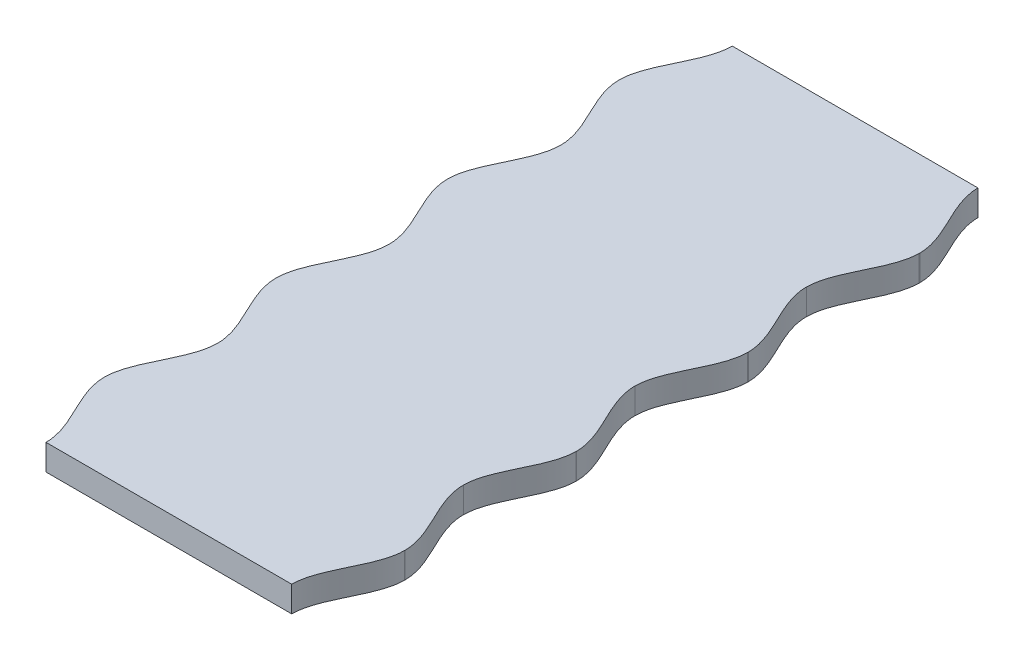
ISO-10303-21;
HEADER;
FILE_DESCRIPTION(('STEP AP214'),'2;1');
FILE_NAME('part.step','',(''),(''),'','','');
FILE_SCHEMA(('AUTOMOTIVE_DESIGN { 1 0 10303 214 1 1 1 1 }'));
ENDSEC;
DATA;
#1=APPLICATION_CONTEXT('core data for automotive mechanical design processes');
#2=APPLICATION_PROTOCOL_DEFINITION('international standard','automotive_design',2000,#1);
#3=PRODUCT_CONTEXT('',#1,'mechanical');
#4=PRODUCT('Part','Part','',(#3));
#5=PRODUCT_RELATED_PRODUCT_CATEGORY('part','',(#4));
#6=PRODUCT_DEFINITION_FORMATION('','',#4);
#7=PRODUCT_DEFINITION_CONTEXT('part definition',#1,'design');
#8=PRODUCT_DEFINITION('design','',#6,#7);
#9=PRODUCT_DEFINITION_SHAPE('','',#8);
#10=(LENGTH_UNIT() NAMED_UNIT(*) SI_UNIT(.MILLI.,.METRE.));
#11=(NAMED_UNIT(*) PLANE_ANGLE_UNIT() SI_UNIT($,.RADIAN.));
#12=(NAMED_UNIT(*) SI_UNIT($,.STERADIAN.) SOLID_ANGLE_UNIT());
#13=UNCERTAINTY_MEASURE_WITH_UNIT(LENGTH_MEASURE(1.E-05),#10,'distance_accuracy_value','');
#14=(GEOMETRIC_REPRESENTATION_CONTEXT(3) GLOBAL_UNCERTAINTY_ASSIGNED_CONTEXT((#13)) GLOBAL_UNIT_ASSIGNED_CONTEXT((#10,
#11,#12)) REPRESENTATION_CONTEXT('',''));
#15=CARTESIAN_POINT('',(0.,0.,0.));
#16=DIRECTION('',(0.,0.,1.));
#17=DIRECTION('',(1.,0.,0.));
#18=AXIS2_PLACEMENT_3D('',#15,#16,#17);
#19=CARTESIAN_POINT('',(-14.31965,3.,-80.));
#20=CARTESIAN_POINT('',(-14.31965,3.,-76.7188));
#21=CARTESIAN_POINT('',(-17.40275,3.,-73.4373));
#22=CARTESIAN_POINT('',(-17.49925,3.,-70.1561));
#23=B_SPLINE_CURVE_WITH_KNOTS('',3,(#19,#20,#21,#22),.UNSPECIFIED.,.F.,.F.,(4,4),
(0.961538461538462,1.),.UNSPECIFIED.);
#24=DIRECTION('',(0.,-1.,0.));
#25=VECTOR('',#24,1.);
#26=SURFACE_OF_LINEAR_EXTRUSION('',#23,#25);
#27=CARTESIAN_POINT('',(-14.31965,0.,-80.));
#28=CARTESIAN_POINT('',(-14.31965,0.,-76.7188));
#29=CARTESIAN_POINT('',(-17.40275,0.,-73.4373));
#30=CARTESIAN_POINT('',(-17.49925,0.,-70.1561));
#31=B_SPLINE_CURVE_WITH_KNOTS('',3,(#27,#28,#29,#30),.UNSPECIFIED.,.F.,.F.,(4,4),
(0.961538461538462,1.),.UNSPECIFIED.);
#32=CARTESIAN_POINT('',(-14.31965,0.,-80.));
#33=VERTEX_POINT('',#32);
#34=CARTESIAN_POINT('',(-17.49925,0.,-70.1561));
#35=VERTEX_POINT('',#34);
#36=EDGE_CURVE('E424',#33,#35,#31,.T.);
#37=ORIENTED_EDGE('',*,*,#36,.T.);
#38=DIRECTION('',(0.,-1.,0.));
#39=VECTOR('',#38,1.);
#40=CARTESIAN_POINT('',(-17.49925,3.,-70.1561));
#41=LINE('',#40,#39);
#42=CARTESIAN_POINT('',(-17.49925,3.,-70.1561));
#43=VERTEX_POINT('',#42);
#44=EDGE_CURVE('E11',#43,#35,#41,.T.);
#45=ORIENTED_EDGE('',*,*,#44,.F.);
#46=CARTESIAN_POINT('',(-14.31965,3.,-80.));
#47=VERTEX_POINT('',#46);
#48=EDGE_CURVE('E538',#47,#43,#23,.T.);
#49=ORIENTED_EDGE('',*,*,#48,.F.);
#50=DIRECTION('',(0.,-1.,0.));
#51=VECTOR('',#50,1.);
#52=CARTESIAN_POINT('',(-14.31965,3.,-80.));
#53=LINE('',#52,#51);
#54=EDGE_CURVE('E234',#47,#33,#53,.T.);
#55=ORIENTED_EDGE('',*,*,#54,.T.);
#56=EDGE_LOOP('',(#37,#45,#49,#55));
#57=FACE_BOUND('',#56,.T.);
#58=ADVANCED_FACE('F33',(#57),#26,.F.);
#59=CARTESIAN_POINT('',(-17.49925,3.,-69.8436));
#60=DIRECTION('',(1.,0.,0.));
#61=DIRECTION('',(0.,0.,-1.));
#62=AXIS2_PLACEMENT_3D('',#59,#60,#61);
#63=PLANE('',#62);
#64=DIRECTION('',(0.,0.,1.));
#65=VECTOR('',#64,1.);
#66=CARTESIAN_POINT('',(-17.49925,0.,-69.8436));
#67=LINE('',#66,#65);
#68=CARTESIAN_POINT('',(-17.49925,0.,-69.8436));
#69=VERTEX_POINT('',#68);
#70=EDGE_CURVE('E418',#35,#69,#67,.T.);
#71=ORIENTED_EDGE('',*,*,#70,.T.);
#72=DIRECTION('',(0.,-1.,0.));
#73=VECTOR('',#72,1.);
#74=CARTESIAN_POINT('',(-17.49925,3.,-69.8436));
#75=LINE('',#74,#73);
#76=CARTESIAN_POINT('',(-17.49925,3.,-69.8436));
#77=VERTEX_POINT('',#76);
#78=EDGE_CURVE('E42',#77,#69,#75,.T.);
#79=ORIENTED_EDGE('',*,*,#78,.F.);
#80=DIRECTION('',(0.,0.,1.));
#81=VECTOR('',#80,1.);
#82=CARTESIAN_POINT('',(-17.49925,3.,-69.8436));
#83=LINE('',#82,#81);
#84=EDGE_CURVE('E147',#43,#77,#83,.T.);
#85=ORIENTED_EDGE('',*,*,#84,.F.);
#86=ORIENTED_EDGE('',*,*,#44,.T.);
#87=EDGE_LOOP('',(#71,#79,#85,#86));
#88=FACE_BOUND('',#87,.T.);
#89=ADVANCED_FACE('F572',(#88),#63,.F.);
#90=CARTESIAN_POINT('',(-17.49925,3.,-69.8436));
#91=CARTESIAN_POINT('',(-17.40275,3.,-66.5624));
#92=CARTESIAN_POINT('',(-14.31965,3.,-63.2811));
#93=CARTESIAN_POINT('',(-14.31965,3.,-59.9999));
#94=B_SPLINE_CURVE_WITH_KNOTS('',3,(#90,#91,#92,#93),.UNSPECIFIED.,.F.,.F.,(4,4),
(0.884615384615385,0.923076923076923),.UNSPECIFIED.);
#95=DIRECTION('',(0.,-1.,0.));
#96=VECTOR('',#95,1.);
#97=SURFACE_OF_LINEAR_EXTRUSION('',#94,#96);
#98=CARTESIAN_POINT('',(-17.49925,0.,-69.8436));
#99=CARTESIAN_POINT('',(-17.40275,0.,-66.5624));
#100=CARTESIAN_POINT('',(-14.31965,0.,-63.2811));
#101=CARTESIAN_POINT('',(-14.31965,0.,-59.9999));
#102=B_SPLINE_CURVE_WITH_KNOTS('',3,(#98,#99,#100,#101),.UNSPECIFIED.,.F.,.F.,(4,4),
(0.884615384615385,0.923076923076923),.UNSPECIFIED.);
#103=CARTESIAN_POINT('',(-14.31965,0.,-59.9999));
#104=VERTEX_POINT('',#103);
#105=EDGE_CURVE('E412',#69,#104,#102,.T.);
#106=ORIENTED_EDGE('',*,*,#105,.T.);
#107=DIRECTION('',(0.,-1.,0.));
#108=VECTOR('',#107,1.);
#109=CARTESIAN_POINT('',(-14.31965,3.,-59.9999));
#110=LINE('',#109,#108);
#111=CARTESIAN_POINT('',(-14.31965,3.,-59.9999));
#112=VERTEX_POINT('',#111);
#113=EDGE_CURVE('E404',#112,#104,#110,.T.);
#114=ORIENTED_EDGE('',*,*,#113,.F.);
#115=EDGE_CURVE('E413',#77,#112,#94,.T.);
#116=ORIENTED_EDGE('',*,*,#115,.F.);
#117=ORIENTED_EDGE('',*,*,#78,.T.);
#118=EDGE_LOOP('',(#106,#114,#116,#117));
#119=FACE_BOUND('',#118,.T.);
#120=ADVANCED_FACE('F410',(#119),#97,.F.);
#121=CARTESIAN_POINT('',(-14.31965,3.,-59.9999));
#122=CARTESIAN_POINT('',(-14.31965,3.,-56.7187));
#123=CARTESIAN_POINT('',(-17.40275,3.,-53.4374));
#124=CARTESIAN_POINT('',(-17.49925,3.,-50.1562));
#125=B_SPLINE_CURVE_WITH_KNOTS('',3,(#121,#122,#123,#124),.UNSPECIFIED.,.F.,.F.,(4,4),
(0.846153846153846,0.884615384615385),.UNSPECIFIED.);
#126=DIRECTION('',(0.,-1.,0.));
#127=VECTOR('',#126,1.);
#128=SURFACE_OF_LINEAR_EXTRUSION('',#125,#127);
#129=CARTESIAN_POINT('',(-14.31965,0.,-59.9999));
#130=CARTESIAN_POINT('',(-14.31965,0.,-56.7187));
#131=CARTESIAN_POINT('',(-17.40275,0.,-53.4374));
#132=CARTESIAN_POINT('',(-17.49925,0.,-50.1562));
#133=B_SPLINE_CURVE_WITH_KNOTS('',3,(#129,#130,#131,#132),.UNSPECIFIED.,.F.,.F.,(4,4),
(0.846153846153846,0.884615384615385),.UNSPECIFIED.);
#134=CARTESIAN_POINT('',(-17.49925,0.,-50.1562));
#135=VERTEX_POINT('',#134);
#136=EDGE_CURVE('E420',#104,#135,#133,.T.);
#137=ORIENTED_EDGE('',*,*,#136,.T.);
#138=DIRECTION('',(0.,-1.,0.));
#139=VECTOR('',#138,1.);
#140=CARTESIAN_POINT('',(-17.49925,3.,-50.1562));
#141=LINE('',#140,#139);
#142=CARTESIAN_POINT('',(-17.49925,3.,-50.1562));
#143=VERTEX_POINT('',#142);
#144=EDGE_CURVE('E401',#143,#135,#141,.T.);
#145=ORIENTED_EDGE('',*,*,#144,.F.);
#146=EDGE_CURVE('E560',#112,#143,#125,.T.);
#147=ORIENTED_EDGE('',*,*,#146,.F.);
#148=ORIENTED_EDGE('',*,*,#113,.T.);
#149=EDGE_LOOP('',(#137,#145,#147,#148));
#150=FACE_BOUND('',#149,.T.);
#151=ADVANCED_FACE('F571',(#150),#128,.F.);
#152=CARTESIAN_POINT('',(-17.49925,3.,-49.8437));
#153=DIRECTION('',(1.,0.,0.));
#154=DIRECTION('',(0.,0.,-1.));
#155=AXIS2_PLACEMENT_3D('',#152,#153,#154);
#156=PLANE('',#155);
#157=DIRECTION('',(0.,0.,1.));
#158=VECTOR('',#157,1.);
#159=CARTESIAN_POINT('',(-17.49925,0.,-49.8437));
#160=LINE('',#159,#158);
#161=CARTESIAN_POINT('',(-17.49925,0.,-49.8437));
#162=VERTEX_POINT('',#161);
#163=EDGE_CURVE('E422',#135,#162,#160,.T.);
#164=ORIENTED_EDGE('',*,*,#163,.T.);
#165=DIRECTION('',(0.,-1.,0.));
#166=VECTOR('',#165,1.);
#167=CARTESIAN_POINT('',(-17.49925,3.,-49.8437));
#168=LINE('',#167,#166);
#169=CARTESIAN_POINT('',(-17.49925,3.,-49.8437));
#170=VERTEX_POINT('',#169);
#171=EDGE_CURVE('E398',#170,#162,#168,.T.);
#172=ORIENTED_EDGE('',*,*,#171,.F.);
#173=DIRECTION('',(0.,0.,1.));
#174=VECTOR('',#173,1.);
#175=CARTESIAN_POINT('',(-17.49925,3.,-49.8437));
#176=LINE('',#175,#174);
#177=EDGE_CURVE('E885',#143,#170,#176,.T.);
#178=ORIENTED_EDGE('',*,*,#177,.F.);
#179=ORIENTED_EDGE('',*,*,#144,.T.);
#180=EDGE_LOOP('',(#164,#172,#178,#179));
#181=FACE_BOUND('',#180,.T.);
#182=ADVANCED_FACE('F599',(#181),#156,.F.);
#183=CARTESIAN_POINT('',(-17.49925,3.,-49.8437));
#184=CARTESIAN_POINT('',(-17.40275,3.,-46.5625));
#185=CARTESIAN_POINT('',(-14.31965,3.,-43.2811));
#186=CARTESIAN_POINT('',(-14.31965,3.,-39.9999));
#187=B_SPLINE_CURVE_WITH_KNOTS('',3,(#183,#184,#185,#186),.UNSPECIFIED.,.F.,.F.,(4,4),
(0.769230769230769,0.807692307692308),.UNSPECIFIED.);
#188=DIRECTION('',(0.,-1.,0.));
#189=VECTOR('',#188,1.);
#190=SURFACE_OF_LINEAR_EXTRUSION('',#187,#189);
#191=CARTESIAN_POINT('',(-17.49925,0.,-49.8437));
#192=CARTESIAN_POINT('',(-17.40275,0.,-46.5625));
#193=CARTESIAN_POINT('',(-14.31965,0.,-43.2811));
#194=CARTESIAN_POINT('',(-14.31965,0.,-39.9999));
#195=B_SPLINE_CURVE_WITH_KNOTS('',3,(#191,#192,#193,#194),.UNSPECIFIED.,.F.,.F.,(4,4),
(0.769230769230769,0.807692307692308),.UNSPECIFIED.);
#196=CARTESIAN_POINT('',(-14.31965,0.,-39.9999));
#197=VERTEX_POINT('',#196);
#198=EDGE_CURVE('E438',#162,#197,#195,.T.);
#199=ORIENTED_EDGE('',*,*,#198,.T.);
#200=DIRECTION('',(0.,-1.,0.));
#201=VECTOR('',#200,1.);
#202=CARTESIAN_POINT('',(-14.31965,3.,-39.9999));
#203=LINE('',#202,#201);
#204=CARTESIAN_POINT('',(-14.31965,3.,-39.9999));
#205=VERTEX_POINT('',#204);
#206=EDGE_CURVE('E395',#205,#197,#203,.T.);
#207=ORIENTED_EDGE('',*,*,#206,.F.);
#208=EDGE_CURVE('E848',#170,#205,#187,.T.);
#209=ORIENTED_EDGE('',*,*,#208,.F.);
#210=ORIENTED_EDGE('',*,*,#171,.T.);
#211=EDGE_LOOP('',(#199,#207,#209,#210));
#212=FACE_BOUND('',#211,.T.);
#213=ADVANCED_FACE('F608',(#212),#190,.F.);
#214=CARTESIAN_POINT('',(-14.31965,3.,-39.9999));
#215=CARTESIAN_POINT('',(-14.31965,3.,-36.7187));
#216=CARTESIAN_POINT('',(-17.40275,3.,-33.4374));
#217=CARTESIAN_POINT('',(-17.49925,3.,-30.1562));
#218=B_SPLINE_CURVE_WITH_KNOTS('',3,(#214,#215,#216,#217),.UNSPECIFIED.,.F.,.F.,(4,4),
(0.730769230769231,0.769230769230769),.UNSPECIFIED.);
#219=DIRECTION('',(0.,-1.,0.));
#220=VECTOR('',#219,1.);
#221=SURFACE_OF_LINEAR_EXTRUSION('',#218,#220);
#222=CARTESIAN_POINT('',(-14.31965,0.,-39.9999));
#223=CARTESIAN_POINT('',(-14.31965,0.,-36.7187));
#224=CARTESIAN_POINT('',(-17.40275,0.,-33.4374));
#225=CARTESIAN_POINT('',(-17.49925,0.,-30.1562));
#226=B_SPLINE_CURVE_WITH_KNOTS('',3,(#222,#223,#224,#225),.UNSPECIFIED.,.F.,.F.,(4,4),
(0.730769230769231,0.769230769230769),.UNSPECIFIED.);
#227=CARTESIAN_POINT('',(-17.49925,0.,-30.1562));
#228=VERTEX_POINT('',#227);
#229=EDGE_CURVE('E442',#197,#228,#226,.T.);
#230=ORIENTED_EDGE('',*,*,#229,.T.);
#231=DIRECTION('',(0.,-1.,0.));
#232=VECTOR('',#231,1.);
#233=CARTESIAN_POINT('',(-17.49925,3.,-30.1562));
#234=LINE('',#233,#232);
#235=CARTESIAN_POINT('',(-17.49925,3.,-30.1562));
#236=VERTEX_POINT('',#235);
#237=EDGE_CURVE('E392',#236,#228,#234,.T.);
#238=ORIENTED_EDGE('',*,*,#237,.F.);
#239=EDGE_CURVE('E843',#205,#236,#218,.T.);
#240=ORIENTED_EDGE('',*,*,#239,.F.);
#241=ORIENTED_EDGE('',*,*,#206,.T.);
#242=EDGE_LOOP('',(#230,#238,#240,#241));
#243=FACE_BOUND('',#242,.T.);
#244=ADVANCED_FACE('F617',(#243),#221,.F.);
#245=CARTESIAN_POINT('',(-17.49925,3.,-29.8437));
#246=DIRECTION('',(1.,0.,0.));
#247=DIRECTION('',(0.,0.,-1.));
#248=AXIS2_PLACEMENT_3D('',#245,#246,#247);
#249=PLANE('',#248);
#250=DIRECTION('',(0.,0.,1.));
#251=VECTOR('',#250,1.);
#252=CARTESIAN_POINT('',(-17.49925,0.,-29.8437));
#253=LINE('',#252,#251);
#254=CARTESIAN_POINT('',(-17.49925,0.,-29.8437));
#255=VERTEX_POINT('',#254);
#256=EDGE_CURVE('E449',#228,#255,#253,.T.);
#257=ORIENTED_EDGE('',*,*,#256,.T.);
#258=DIRECTION('',(0.,-1.,0.));
#259=VECTOR('',#258,1.);
#260=CARTESIAN_POINT('',(-17.49925,3.,-29.8437));
#261=LINE('',#260,#259);
#262=CARTESIAN_POINT('',(-17.49925,3.,-29.8437));
#263=VERTEX_POINT('',#262);
#264=EDGE_CURVE('E389',#263,#255,#261,.T.);
#265=ORIENTED_EDGE('',*,*,#264,.F.);
#266=DIRECTION('',(0.,0.,1.));
#267=VECTOR('',#266,1.);
#268=CARTESIAN_POINT('',(-17.49925,3.,-29.8437));
#269=LINE('',#268,#267);
#270=EDGE_CURVE('E847',#236,#263,#269,.T.);
#271=ORIENTED_EDGE('',*,*,#270,.F.);
#272=ORIENTED_EDGE('',*,*,#237,.T.);
#273=EDGE_LOOP('',(#257,#265,#271,#272));
#274=FACE_BOUND('',#273,.T.);
#275=ADVANCED_FACE('F627',(#274),#249,.F.);
#276=CARTESIAN_POINT('',(-17.49925,3.,-29.8437));
#277=CARTESIAN_POINT('',(-17.40275,3.,-26.5625));
#278=CARTESIAN_POINT('',(-14.31965,3.,-23.2812));
#279=CARTESIAN_POINT('',(-14.31965,3.,-20.));
#280=B_SPLINE_CURVE_WITH_KNOTS('',3,(#276,#277,#278,#279),.UNSPECIFIED.,.F.,.F.,(4,4),
(0.653846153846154,0.692307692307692),.UNSPECIFIED.);
#281=DIRECTION('',(0.,-1.,0.));
#282=VECTOR('',#281,1.);
#283=SURFACE_OF_LINEAR_EXTRUSION('',#280,#282);
#284=CARTESIAN_POINT('',(-17.49925,0.,-29.8437));
#285=CARTESIAN_POINT('',(-17.40275,0.,-26.5625));
#286=CARTESIAN_POINT('',(-14.31965,0.,-23.2812));
#287=CARTESIAN_POINT('',(-14.31965,0.,-20.));
#288=B_SPLINE_CURVE_WITH_KNOTS('',3,(#284,#285,#286,#287),.UNSPECIFIED.,.F.,.F.,(4,4),
(0.653846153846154,0.692307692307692),.UNSPECIFIED.);
#289=CARTESIAN_POINT('',(-14.31965,0.,-20.));
#290=VERTEX_POINT('',#289);
#291=EDGE_CURVE('E454',#255,#290,#288,.T.);
#292=ORIENTED_EDGE('',*,*,#291,.T.);
#293=DIRECTION('',(0.,-1.,0.));
#294=VECTOR('',#293,1.);
#295=CARTESIAN_POINT('',(-14.31965,3.,-20.));
#296=LINE('',#295,#294);
#297=CARTESIAN_POINT('',(-14.31965,3.,-20.));
#298=VERTEX_POINT('',#297);
#299=EDGE_CURVE('E386',#298,#290,#296,.T.);
#300=ORIENTED_EDGE('',*,*,#299,.F.);
#301=EDGE_CURVE('E833',#263,#298,#280,.T.);
#302=ORIENTED_EDGE('',*,*,#301,.F.);
#303=ORIENTED_EDGE('',*,*,#264,.T.);
#304=EDGE_LOOP('',(#292,#300,#302,#303));
#305=FACE_BOUND('',#304,.T.);
#306=ADVANCED_FACE('F637',(#305),#283,.F.);
#307=CARTESIAN_POINT('',(-14.31965,3.,-20.));
#308=CARTESIAN_POINT('',(-14.31965,3.,-16.7188));
#309=CARTESIAN_POINT('',(-17.40275,3.,-13.4374));
#310=CARTESIAN_POINT('',(-17.49925,3.,-10.1563));
#311=B_SPLINE_CURVE_WITH_KNOTS('',3,(#307,#308,#309,#310),.UNSPECIFIED.,.F.,.F.,(4,4),
(0.615384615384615,0.653846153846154),.UNSPECIFIED.);
#312=DIRECTION('',(0.,-1.,0.));
#313=VECTOR('',#312,1.);
#314=SURFACE_OF_LINEAR_EXTRUSION('',#311,#313);
#315=CARTESIAN_POINT('',(-14.31965,0.,-20.));
#316=CARTESIAN_POINT('',(-14.31965,0.,-16.7188));
#317=CARTESIAN_POINT('',(-17.40275,0.,-13.4374));
#318=CARTESIAN_POINT('',(-17.49925,0.,-10.1563));
#319=B_SPLINE_CURVE_WITH_KNOTS('',3,(#315,#316,#317,#318),.UNSPECIFIED.,.F.,.F.,(4,4),
(0.615384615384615,0.653846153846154),.UNSPECIFIED.);
#320=CARTESIAN_POINT('',(-17.49925,0.,-10.1563));
#321=VERTEX_POINT('',#320);
#322=EDGE_CURVE('E458',#290,#321,#319,.T.);
#323=ORIENTED_EDGE('',*,*,#322,.T.);
#324=DIRECTION('',(0.,-1.,0.));
#325=VECTOR('',#324,1.);
#326=CARTESIAN_POINT('',(-17.49925,3.,-10.1563));
#327=LINE('',#326,#325);
#328=CARTESIAN_POINT('',(-17.49925,3.,-10.1563));
#329=VERTEX_POINT('',#328);
#330=EDGE_CURVE('E383',#329,#321,#327,.T.);
#331=ORIENTED_EDGE('',*,*,#330,.F.);
#332=EDGE_CURVE('E828',#298,#329,#311,.T.);
#333=ORIENTED_EDGE('',*,*,#332,.F.);
#334=ORIENTED_EDGE('',*,*,#299,.T.);
#335=EDGE_LOOP('',(#323,#331,#333,#334));
#336=FACE_BOUND('',#335,.T.);
#337=ADVANCED_FACE('F647',(#336),#314,.F.);
#338=CARTESIAN_POINT('',(-17.49925,3.,-9.8437));
#339=DIRECTION('',(1.,0.,0.));
#340=DIRECTION('',(0.,0.,-1.));
#341=AXIS2_PLACEMENT_3D('',#338,#339,#340);
#342=PLANE('',#341);
#343=DIRECTION('',(0.,0.,1.));
#344=VECTOR('',#343,1.);
#345=CARTESIAN_POINT('',(-17.49925,0.,-9.8437));
#346=LINE('',#345,#344);
#347=CARTESIAN_POINT('',(-17.49925,0.,-9.8437));
#348=VERTEX_POINT('',#347);
#349=EDGE_CURVE('E465',#321,#348,#346,.T.);
#350=ORIENTED_EDGE('',*,*,#349,.T.);
#351=DIRECTION('',(0.,-1.,0.));
#352=VECTOR('',#351,1.);
#353=CARTESIAN_POINT('',(-17.49925,3.,-9.8437));
#354=LINE('',#353,#352);
#355=CARTESIAN_POINT('',(-17.49925,3.,-9.8437));
#356=VERTEX_POINT('',#355);
#357=EDGE_CURVE('E380',#356,#348,#354,.T.);
#358=ORIENTED_EDGE('',*,*,#357,.F.);
#359=DIRECTION('',(0.,0.,1.));
#360=VECTOR('',#359,1.);
#361=CARTESIAN_POINT('',(-17.49925,3.,-9.8437));
#362=LINE('',#361,#360);
#363=EDGE_CURVE('E823',#329,#356,#362,.T.);
#364=ORIENTED_EDGE('',*,*,#363,.F.);
#365=ORIENTED_EDGE('',*,*,#330,.T.);
#366=EDGE_LOOP('',(#350,#358,#364,#365));
#367=FACE_BOUND('',#366,.T.);
#368=ADVANCED_FACE('F657',(#367),#342,.F.);
#369=CARTESIAN_POINT('',(-17.49925,3.,-9.8437));
#370=CARTESIAN_POINT('',(-17.40275,3.,-6.5625));
#371=CARTESIAN_POINT('',(-14.31965,3.,-3.2812));
#372=CARTESIAN_POINT('',(-14.31965,3.,0.));
#373=B_SPLINE_CURVE_WITH_KNOTS('',3,(#369,#370,#371,#372),.UNSPECIFIED.,.F.,.F.,(4,4),
(0.538461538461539,0.576923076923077),.UNSPECIFIED.);
#374=DIRECTION('',(0.,-1.,0.));
#375=VECTOR('',#374,1.);
#376=SURFACE_OF_LINEAR_EXTRUSION('',#373,#375);
#377=CARTESIAN_POINT('',(-17.49925,0.,-9.8437));
#378=CARTESIAN_POINT('',(-17.40275,0.,-6.5625));
#379=CARTESIAN_POINT('',(-14.31965,0.,-3.2812));
#380=CARTESIAN_POINT('',(-14.31965,0.,0.));
#381=B_SPLINE_CURVE_WITH_KNOTS('',3,(#377,#378,#379,#380),.UNSPECIFIED.,.F.,.F.,(4,4),
(0.538461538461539,0.576923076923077),.UNSPECIFIED.);
#382=CARTESIAN_POINT('',(-14.31965,0.,0.));
#383=VERTEX_POINT('',#382);
#384=EDGE_CURVE('E470',#348,#383,#381,.T.);
#385=ORIENTED_EDGE('',*,*,#384,.T.);
#386=DIRECTION('',(0.,-1.,0.));
#387=VECTOR('',#386,1.);
#388=CARTESIAN_POINT('',(-14.31965,3.,0.));
#389=LINE('',#388,#387);
#390=CARTESIAN_POINT('',(-14.31965,3.,0.));
#391=VERTEX_POINT('',#390);
#392=EDGE_CURVE('E377',#391,#383,#389,.T.);
#393=ORIENTED_EDGE('',*,*,#392,.F.);
#394=EDGE_CURVE('E818',#356,#391,#373,.T.);
#395=ORIENTED_EDGE('',*,*,#394,.F.);
#396=ORIENTED_EDGE('',*,*,#357,.T.);
#397=EDGE_LOOP('',(#385,#393,#395,#396));
#398=FACE_BOUND('',#397,.T.);
#399=ADVANCED_FACE('F667',(#398),#376,.F.);
#400=CARTESIAN_POINT('',(14.31965,3.,0.));
#401=DIRECTION('',(0.,0.,-1.));
#402=DIRECTION('',(-1.,0.,0.));
#403=AXIS2_PLACEMENT_3D('',#400,#401,#402);
#404=PLANE('',#403);
#405=DIRECTION('',(1.,0.,0.));
#406=VECTOR('',#405,1.);
#407=CARTESIAN_POINT('',(14.31965,0.,0.));
#408=LINE('',#407,#406);
#409=CARTESIAN_POINT('',(14.31965,0.,0.));
#410=VERTEX_POINT('',#409);
#411=EDGE_CURVE('E474',#383,#410,#408,.T.);
#412=ORIENTED_EDGE('',*,*,#411,.T.);
#413=DIRECTION('',(0.,-1.,0.));
#414=VECTOR('',#413,1.);
#415=CARTESIAN_POINT('',(14.31965,3.,0.));
#416=LINE('',#415,#414);
#417=CARTESIAN_POINT('',(14.31965,3.,0.));
#418=VERTEX_POINT('',#417);
#419=EDGE_CURVE('E374',#418,#410,#416,.T.);
#420=ORIENTED_EDGE('',*,*,#419,.F.);
#421=DIRECTION('',(1.,0.,0.));
#422=VECTOR('',#421,1.);
#423=CARTESIAN_POINT('',(14.31965,3.,0.));
#424=LINE('',#423,#422);
#425=EDGE_CURVE('E808',#391,#418,#424,.T.);
#426=ORIENTED_EDGE('',*,*,#425,.F.);
#427=ORIENTED_EDGE('',*,*,#392,.T.);
#428=EDGE_LOOP('',(#412,#420,#426,#427));
#429=FACE_BOUND('',#428,.T.);
#430=ADVANCED_FACE('F677',(#429),#404,.F.);
#431=CARTESIAN_POINT('',(14.31965,3.,0.));
#432=CARTESIAN_POINT('',(14.31965,3.,-3.3184));
#433=CARTESIAN_POINT('',(17.47275,3.,-6.6369));
#434=CARTESIAN_POINT('',(17.5007500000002,3.,-9.9553));
#435=B_SPLINE_CURVE_WITH_KNOTS('',3,(#431,#432,#433,#434),.UNSPECIFIED.,.F.,.F.,(4,4),
(0.461538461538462,0.5),.UNSPECIFIED.);
#436=DIRECTION('',(0.,-1.,0.));
#437=VECTOR('',#436,1.);
#438=SURFACE_OF_LINEAR_EXTRUSION('',#435,#437);
#439=CARTESIAN_POINT('',(14.31965,0.,0.));
#440=CARTESIAN_POINT('',(14.31965,0.,-3.3184));
#441=CARTESIAN_POINT('',(17.47275,0.,-6.6369));
#442=CARTESIAN_POINT('',(17.5007500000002,0.,-9.9553));
#443=B_SPLINE_CURVE_WITH_KNOTS('',3,(#439,#440,#441,#442),.UNSPECIFIED.,.F.,.F.,(4,4),
(0.461538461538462,0.5),.UNSPECIFIED.);
#444=CARTESIAN_POINT('',(17.5007500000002,0.,-9.9553));
#445=VERTEX_POINT('',#444);
#446=EDGE_CURVE('E479',#410,#445,#443,.T.);
#447=ORIENTED_EDGE('',*,*,#446,.T.);
#448=DIRECTION('',(0.,-1.,0.));
#449=VECTOR('',#448,1.);
#450=CARTESIAN_POINT('',(17.5007500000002,3.,-9.9553));
#451=LINE('',#450,#449);
#452=CARTESIAN_POINT('',(17.5007500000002,3.,-9.9553));
#453=VERTEX_POINT('',#452);
#454=EDGE_CURVE('E371',#453,#445,#451,.T.);
#455=ORIENTED_EDGE('',*,*,#454,.F.);
#456=EDGE_CURVE('E807',#418,#453,#435,.T.);
#457=ORIENTED_EDGE('',*,*,#456,.F.);
#458=ORIENTED_EDGE('',*,*,#419,.T.);
#459=EDGE_LOOP('',(#447,#455,#457,#458));
#460=FACE_BOUND('',#459,.T.);
#461=ADVANCED_FACE('F687',(#460),#438,.F.);
#462=CARTESIAN_POINT('',(17.5007500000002,3.,-10.0447));
#463=DIRECTION('',(-1.,0.,0.));
#464=DIRECTION('',(0.,0.,1.));
#465=AXIS2_PLACEMENT_3D('',#462,#463,#464);
#466=PLANE('',#465);
#467=DIRECTION('',(0.,0.,-1.));
#468=VECTOR('',#467,1.);
#469=CARTESIAN_POINT('',(17.5007500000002,0.,-10.0447));
#470=LINE('',#469,#468);
#471=CARTESIAN_POINT('',(17.5007500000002,0.,-10.0447));
#472=VERTEX_POINT('',#471);
#473=EDGE_CURVE('E483',#445,#472,#470,.T.);
#474=ORIENTED_EDGE('',*,*,#473,.T.);
#475=DIRECTION('',(0.,-1.,0.));
#476=VECTOR('',#475,1.);
#477=CARTESIAN_POINT('',(17.5007500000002,3.,-10.0447));
#478=LINE('',#477,#476);
#479=CARTESIAN_POINT('',(17.5007500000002,3.,-10.0447));
#480=VERTEX_POINT('',#479);
#481=EDGE_CURVE('E368',#480,#472,#478,.T.);
#482=ORIENTED_EDGE('',*,*,#481,.F.);
#483=DIRECTION('',(0.,0.,-1.));
#484=VECTOR('',#483,1.);
#485=CARTESIAN_POINT('',(17.5007500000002,3.,-10.0447));
#486=LINE('',#485,#484);
#487=EDGE_CURVE('E806',#453,#480,#486,.T.);
#488=ORIENTED_EDGE('',*,*,#487,.F.);
#489=ORIENTED_EDGE('',*,*,#454,.T.);
#490=EDGE_LOOP('',(#474,#482,#488,#489));
#491=FACE_BOUND('',#490,.T.);
#492=ADVANCED_FACE('F697',(#491),#466,.F.);
#493=CARTESIAN_POINT('',(17.5007500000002,3.,-10.0447));
#494=CARTESIAN_POINT('',(17.47275,3.,-13.363));
#495=CARTESIAN_POINT('',(14.31965,3.,-16.6816));
#496=CARTESIAN_POINT('',(14.31965,3.,-20.));
#497=B_SPLINE_CURVE_WITH_KNOTS('',3,(#493,#494,#495,#496),.UNSPECIFIED.,.F.,.F.,(4,4),
(0.384615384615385,0.423076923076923),.UNSPECIFIED.);
#498=DIRECTION('',(0.,-1.,0.));
#499=VECTOR('',#498,1.);
#500=SURFACE_OF_LINEAR_EXTRUSION('',#497,#499);
#501=CARTESIAN_POINT('',(17.5007500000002,0.,-10.0447));
#502=CARTESIAN_POINT('',(17.47275,0.,-13.363));
#503=CARTESIAN_POINT('',(14.31965,0.,-16.6816));
#504=CARTESIAN_POINT('',(14.31965,0.,-20.));
#505=B_SPLINE_CURVE_WITH_KNOTS('',3,(#501,#502,#503,#504),.UNSPECIFIED.,.F.,.F.,(4,4),
(0.384615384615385,0.423076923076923),.UNSPECIFIED.);
#506=CARTESIAN_POINT('',(14.31965,0.,-20.));
#507=VERTEX_POINT('',#506);
#508=EDGE_CURVE('E488',#472,#507,#505,.T.);
#509=ORIENTED_EDGE('',*,*,#508,.T.);
#510=DIRECTION('',(0.,-1.,0.));
#511=VECTOR('',#510,1.);
#512=CARTESIAN_POINT('',(14.31965,3.,-20.));
#513=LINE('',#512,#511);
#514=CARTESIAN_POINT('',(14.31965,3.,-20.));
#515=VERTEX_POINT('',#514);
#516=EDGE_CURVE('E365',#515,#507,#513,.T.);
#517=ORIENTED_EDGE('',*,*,#516,.F.);
#518=EDGE_CURVE('E315',#480,#515,#497,.T.);
#519=ORIENTED_EDGE('',*,*,#518,.F.);
#520=ORIENTED_EDGE('',*,*,#481,.T.);
#521=EDGE_LOOP('',(#509,#517,#519,#520));
#522=FACE_BOUND('',#521,.T.);
#523=ADVANCED_FACE('F306',(#522),#500,.F.);
#524=CARTESIAN_POINT('',(14.31965,3.,-20.));
#525=CARTESIAN_POINT('',(14.31965,3.,-23.3184));
#526=CARTESIAN_POINT('',(17.47275,3.,-26.6369));
#527=CARTESIAN_POINT('',(17.5007500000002,3.,-29.9553));
#528=B_SPLINE_CURVE_WITH_KNOTS('',3,(#524,#525,#526,#527),.UNSPECIFIED.,.F.,.F.,(4,4),
(0.346153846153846,0.384615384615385),.UNSPECIFIED.);
#529=DIRECTION('',(0.,-1.,0.));
#530=VECTOR('',#529,1.);
#531=SURFACE_OF_LINEAR_EXTRUSION('',#528,#530);
#532=CARTESIAN_POINT('',(14.31965,0.,-20.));
#533=CARTESIAN_POINT('',(14.31965,0.,-23.3184));
#534=CARTESIAN_POINT('',(17.47275,0.,-26.6369));
#535=CARTESIAN_POINT('',(17.5007500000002,0.,-29.9553));
#536=B_SPLINE_CURVE_WITH_KNOTS('',3,(#532,#533,#534,#535),.UNSPECIFIED.,.F.,.F.,(4,4),
(0.346153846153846,0.384615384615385),.UNSPECIFIED.);
#537=CARTESIAN_POINT('',(17.5007500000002,0.,-29.9553));
#538=VERTEX_POINT('',#537);
#539=EDGE_CURVE('E492',#507,#538,#536,.T.);
#540=ORIENTED_EDGE('',*,*,#539,.T.);
#541=DIRECTION('',(0.,-1.,0.));
#542=VECTOR('',#541,1.);
#543=CARTESIAN_POINT('',(17.5007500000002,3.,-29.9553));
#544=LINE('',#543,#542);
#545=CARTESIAN_POINT('',(17.5007500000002,3.,-29.9553));
#546=VERTEX_POINT('',#545);
#547=EDGE_CURVE('E362',#546,#538,#544,.T.);
#548=ORIENTED_EDGE('',*,*,#547,.F.);
#549=EDGE_CURVE('E310',#515,#546,#528,.T.);
#550=ORIENTED_EDGE('',*,*,#549,.F.);
#551=ORIENTED_EDGE('',*,*,#516,.T.);
#552=EDGE_LOOP('',(#540,#548,#550,#551));
#553=FACE_BOUND('',#552,.T.);
#554=ADVANCED_FACE('F301',(#553),#531,.F.);
#555=CARTESIAN_POINT('',(17.5007500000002,3.,-30.0446));
#556=DIRECTION('',(-1.,0.,0.));
#557=DIRECTION('',(0.,0.,1.));
#558=AXIS2_PLACEMENT_3D('',#555,#556,#557);
#559=PLANE('',#558);
#560=DIRECTION('',(0.,0.,-1.));
#561=VECTOR('',#560,1.);
#562=CARTESIAN_POINT('',(17.5007500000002,0.,-30.0446));
#563=LINE('',#562,#561);
#564=CARTESIAN_POINT('',(17.5007500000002,0.,-30.0446));
#565=VERTEX_POINT('',#564);
#566=EDGE_CURVE('E499',#538,#565,#563,.T.);
#567=ORIENTED_EDGE('',*,*,#566,.T.);
#568=DIRECTION('',(0.,-1.,0.));
#569=VECTOR('',#568,1.);
#570=CARTESIAN_POINT('',(17.5007500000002,3.,-30.0446));
#571=LINE('',#570,#569);
#572=CARTESIAN_POINT('',(17.5007500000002,3.,-30.0446));
#573=VERTEX_POINT('',#572);
#574=EDGE_CURVE('E335',#573,#565,#571,.T.);
#575=ORIENTED_EDGE('',*,*,#574,.F.);
#576=DIRECTION('',(0.,0.,-1.));
#577=VECTOR('',#576,1.);
#578=CARTESIAN_POINT('',(17.5007500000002,3.,-30.0446));
#579=LINE('',#578,#577);
#580=EDGE_CURVE('E314',#546,#573,#579,.T.);
#581=ORIENTED_EDGE('',*,*,#580,.F.);
#582=ORIENTED_EDGE('',*,*,#547,.T.);
#583=EDGE_LOOP('',(#567,#575,#581,#582));
#584=FACE_BOUND('',#583,.T.);
#585=ADVANCED_FACE('F297',(#584),#559,.F.);
#586=CARTESIAN_POINT('',(17.5007500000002,3.,-30.0446));
#587=CARTESIAN_POINT('',(17.47275,3.,-33.363));
#588=CARTESIAN_POINT('',(14.31965,3.,-36.6815));
#589=CARTESIAN_POINT('',(14.31965,3.,-39.9999));
#590=B_SPLINE_CURVE_WITH_KNOTS('',3,(#586,#587,#588,#589),.UNSPECIFIED.,.F.,.F.,(4,4),
(0.269230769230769,0.307692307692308),.UNSPECIFIED.);
#591=DIRECTION('',(0.,-1.,0.));
#592=VECTOR('',#591,1.);
#593=SURFACE_OF_LINEAR_EXTRUSION('',#590,#592);
#594=CARTESIAN_POINT('',(17.5007500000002,0.,-30.0446));
#595=CARTESIAN_POINT('',(17.47275,0.,-33.363));
#596=CARTESIAN_POINT('',(14.31965,0.,-36.6815));
#597=CARTESIAN_POINT('',(14.31965,0.,-39.9999));
#598=B_SPLINE_CURVE_WITH_KNOTS('',3,(#594,#595,#596,#597),.UNSPECIFIED.,.F.,.F.,(4,4),
(0.269230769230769,0.307692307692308),.UNSPECIFIED.);
#599=CARTESIAN_POINT('',(14.31965,0.,-39.9999));
#600=VERTEX_POINT('',#599);
#601=EDGE_CURVE('E333',#565,#600,#598,.T.);
#602=ORIENTED_EDGE('',*,*,#601,.T.);
#603=DIRECTION('',(0.,-1.,0.));
#604=VECTOR('',#603,1.);
#605=CARTESIAN_POINT('',(14.31965,3.,-39.9999));
#606=LINE('',#605,#604);
#607=CARTESIAN_POINT('',(14.31965,3.,-39.9999));
#608=VERTEX_POINT('',#607);
#609=EDGE_CURVE('E331',#608,#600,#606,.T.);
#610=ORIENTED_EDGE('',*,*,#609,.F.);
#611=EDGE_CURVE('E280',#573,#608,#590,.T.);
#612=ORIENTED_EDGE('',*,*,#611,.F.);
#613=ORIENTED_EDGE('',*,*,#574,.T.);
#614=EDGE_LOOP('',(#602,#610,#612,#613));
#615=FACE_BOUND('',#614,.T.);
#616=ADVANCED_FACE('F293',(#615),#593,.F.);
#617=CARTESIAN_POINT('',(14.31965,3.,-39.9999));
#618=CARTESIAN_POINT('',(14.31965,3.,-43.3183));
#619=CARTESIAN_POINT('',(17.47275,3.,-46.6369));
#620=CARTESIAN_POINT('',(17.5007500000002,3.,-49.9553));
#621=B_SPLINE_CURVE_WITH_KNOTS('',3,(#617,#618,#619,#620),.UNSPECIFIED.,.F.,.F.,(4,4),
(0.230769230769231,0.269230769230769),.UNSPECIFIED.);
#622=DIRECTION('',(0.,-1.,0.));
#623=VECTOR('',#622,1.);
#624=SURFACE_OF_LINEAR_EXTRUSION('',#621,#623);
#625=CARTESIAN_POINT('',(14.31965,0.,-39.9999));
#626=CARTESIAN_POINT('',(14.31965,0.,-43.3183));
#627=CARTESIAN_POINT('',(17.47275,0.,-46.6369));
#628=CARTESIAN_POINT('',(17.5007500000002,0.,-49.9553));
#629=B_SPLINE_CURVE_WITH_KNOTS('',3,(#625,#626,#627,#628),.UNSPECIFIED.,.F.,.F.,(4,4),
(0.230769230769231,0.269230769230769),.UNSPECIFIED.);
#630=CARTESIAN_POINT('',(17.5007500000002,0.,-49.9553));
#631=VERTEX_POINT('',#630);
#632=EDGE_CURVE('E340',#600,#631,#629,.T.);
#633=ORIENTED_EDGE('',*,*,#632,.T.);
#634=DIRECTION('',(0.,-1.,0.));
#635=VECTOR('',#634,1.);
#636=CARTESIAN_POINT('',(17.5007500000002,3.,-49.9553));
#637=LINE('',#636,#635);
#638=CARTESIAN_POINT('',(17.5007500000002,3.,-49.9553));
#639=VERTEX_POINT('',#638);
#640=EDGE_CURVE('E336',#639,#631,#637,.T.);
#641=ORIENTED_EDGE('',*,*,#640,.F.);
#642=EDGE_CURVE('E275',#608,#639,#621,.T.);
#643=ORIENTED_EDGE('',*,*,#642,.F.);
#644=ORIENTED_EDGE('',*,*,#609,.T.);
#645=EDGE_LOOP('',(#633,#641,#643,#644));
#646=FACE_BOUND('',#645,.T.);
#647=ADVANCED_FACE('F289',(#646),#624,.F.);
#648=CARTESIAN_POINT('',(17.5007500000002,3.,-50.0446));
#649=DIRECTION('',(-1.,0.,0.));
#650=DIRECTION('',(0.,0.,1.));
#651=AXIS2_PLACEMENT_3D('',#648,#649,#650);
#652=PLANE('',#651);
#653=DIRECTION('',(0.,0.,-1.));
#654=VECTOR('',#653,1.);
#655=CARTESIAN_POINT('',(17.5007500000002,0.,-50.0446));
#656=LINE('',#655,#654);
#657=CARTESIAN_POINT('',(17.5007500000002,0.,-50.0446));
#658=VERTEX_POINT('',#657);
#659=EDGE_CURVE('E513',#631,#658,#656,.T.);
#660=ORIENTED_EDGE('',*,*,#659,.T.);
#661=DIRECTION('',(0.,-1.,0.));
#662=VECTOR('',#661,1.);
#663=CARTESIAN_POINT('',(17.5007500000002,3.,-50.0446));
#664=LINE('',#663,#662);
#665=CARTESIAN_POINT('',(17.5007500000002,3.,-50.0446));
#666=VERTEX_POINT('',#665);
#667=EDGE_CURVE('E343',#666,#658,#664,.T.);
#668=ORIENTED_EDGE('',*,*,#667,.F.);
#669=DIRECTION('',(0.,0.,-1.));
#670=VECTOR('',#669,1.);
#671=CARTESIAN_POINT('',(17.5007500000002,3.,-50.0446));
#672=LINE('',#671,#670);
#673=EDGE_CURVE('E270',#639,#666,#672,.T.);
#674=ORIENTED_EDGE('',*,*,#673,.F.);
#675=ORIENTED_EDGE('',*,*,#640,.T.);
#676=EDGE_LOOP('',(#660,#668,#674,#675));
#677=FACE_BOUND('',#676,.T.);
#678=ADVANCED_FACE('F292',(#677),#652,.F.);
#679=CARTESIAN_POINT('',(17.5007500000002,3.,-50.0446));
#680=CARTESIAN_POINT('',(17.47275,3.,-53.363));
#681=CARTESIAN_POINT('',(14.31965,3.,-56.6815));
#682=CARTESIAN_POINT('',(14.31965,3.,-59.9999));
#683=B_SPLINE_CURVE_WITH_KNOTS('',3,(#679,#680,#681,#682),.UNSPECIFIED.,.F.,.F.,(4,4),
(0.153846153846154,0.192307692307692),.UNSPECIFIED.);
#684=DIRECTION('',(0.,-1.,0.));
#685=VECTOR('',#684,1.);
#686=SURFACE_OF_LINEAR_EXTRUSION('',#683,#685);
#687=CARTESIAN_POINT('',(17.5007500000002,0.,-50.0446));
#688=CARTESIAN_POINT('',(17.47275,0.,-53.363));
#689=CARTESIAN_POINT('',(14.31965,0.,-56.6815));
#690=CARTESIAN_POINT('',(14.31965,0.,-59.9999));
#691=B_SPLINE_CURVE_WITH_KNOTS('',3,(#687,#688,#689,#690),.UNSPECIFIED.,.F.,.F.,(4,4),
(0.153846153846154,0.192307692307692),.UNSPECIFIED.);
#692=CARTESIAN_POINT('',(14.31965,0.,-59.9999));
#693=VERTEX_POINT('',#692);
#694=EDGE_CURVE('E353',#658,#693,#691,.T.);
#695=ORIENTED_EDGE('',*,*,#694,.T.);
#696=DIRECTION('',(0.,-1.,0.));
#697=VECTOR('',#696,1.);
#698=CARTESIAN_POINT('',(14.31965,3.,-59.9999));
#699=LINE('',#698,#697);
#700=CARTESIAN_POINT('',(14.31965,3.,-59.9999));
#701=VERTEX_POINT('',#700);
#702=EDGE_CURVE('E351',#701,#693,#699,.T.);
#703=ORIENTED_EDGE('',*,*,#702,.F.);
#704=EDGE_CURVE('E262',#666,#701,#683,.T.);
#705=ORIENTED_EDGE('',*,*,#704,.F.);
#706=ORIENTED_EDGE('',*,*,#667,.T.);
#707=EDGE_LOOP('',(#695,#703,#705,#706));
#708=FACE_BOUND('',#707,.T.);
#709=ADVANCED_FACE('F255',(#708),#686,.F.);
#710=CARTESIAN_POINT('',(14.31965,3.,-59.9999));
#711=CARTESIAN_POINT('',(14.31965,3.,-63.3183));
#712=CARTESIAN_POINT('',(17.47275,3.,-66.6368));
#713=CARTESIAN_POINT('',(17.5007500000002,3.,-69.9552));
#714=B_SPLINE_CURVE_WITH_KNOTS('',3,(#710,#711,#712,#713),.UNSPECIFIED.,.F.,.F.,(4,4),
(0.115384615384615,0.153846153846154),.UNSPECIFIED.);
#715=DIRECTION('',(0.,-1.,0.));
#716=VECTOR('',#715,1.);
#717=SURFACE_OF_LINEAR_EXTRUSION('',#714,#716);
#718=CARTESIAN_POINT('',(14.31965,0.,-59.9999));
#719=CARTESIAN_POINT('',(14.31965,0.,-63.3183));
#720=CARTESIAN_POINT('',(17.47275,0.,-66.6368));
#721=CARTESIAN_POINT('',(17.5007500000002,0.,-69.9552));
#722=B_SPLINE_CURVE_WITH_KNOTS('',3,(#718,#719,#720,#721),.UNSPECIFIED.,.F.,.F.,(4,4),
(0.115384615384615,0.153846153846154),.UNSPECIFIED.);
#723=CARTESIAN_POINT('',(17.5007500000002,0.,-69.9552));
#724=VERTEX_POINT('',#723);
#725=EDGE_CURVE('E356',#693,#724,#722,.T.);
#726=ORIENTED_EDGE('',*,*,#725,.T.);
#727=DIRECTION('',(0.,-1.,0.));
#728=VECTOR('',#727,1.);
#729=CARTESIAN_POINT('',(17.5007500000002,3.,-69.9552));
#730=LINE('',#729,#728);
#731=CARTESIAN_POINT('',(17.5007500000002,3.,-69.9552));
#732=VERTEX_POINT('',#731);
#733=EDGE_CURVE('E229',#732,#724,#730,.T.);
#734=ORIENTED_EDGE('',*,*,#733,.F.);
#735=EDGE_CURVE('E220',#701,#732,#714,.T.);
#736=ORIENTED_EDGE('',*,*,#735,.F.);
#737=ORIENTED_EDGE('',*,*,#702,.T.);
#738=EDGE_LOOP('',(#726,#734,#736,#737));
#739=FACE_BOUND('',#738,.T.);
#740=ADVANCED_FACE('F252',(#739),#717,.F.);
#741=CARTESIAN_POINT('',(17.5007500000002,3.,-70.0446));
#742=DIRECTION('',(-1.,0.,0.));
#743=DIRECTION('',(0.,0.,1.));
#744=AXIS2_PLACEMENT_3D('',#741,#742,#743);
#745=PLANE('',#744);
#746=DIRECTION('',(0.,0.,-1.));
#747=VECTOR('',#746,1.);
#748=CARTESIAN_POINT('',(17.5007500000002,0.,-70.0446));
#749=LINE('',#748,#747);
#750=CARTESIAN_POINT('',(17.5007500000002,0.,-70.0446));
#751=VERTEX_POINT('',#750);
#752=EDGE_CURVE('E228',#724,#751,#749,.T.);
#753=ORIENTED_EDGE('',*,*,#752,.T.);
#754=DIRECTION('',(0.,-1.,0.));
#755=VECTOR('',#754,1.);
#756=CARTESIAN_POINT('',(17.5007500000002,3.,-70.0446));
#757=LINE('',#756,#755);
#758=CARTESIAN_POINT('',(17.5007500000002,3.,-70.0446));
#759=VERTEX_POINT('',#758);
#760=EDGE_CURVE('E225',#759,#751,#757,.T.);
#761=ORIENTED_EDGE('',*,*,#760,.F.);
#762=DIRECTION('',(0.,0.,-1.));
#763=VECTOR('',#762,1.);
#764=CARTESIAN_POINT('',(17.5007500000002,3.,-70.0446));
#765=LINE('',#764,#763);
#766=EDGE_CURVE('E214',#732,#759,#765,.T.);
#767=ORIENTED_EDGE('',*,*,#766,.F.);
#768=ORIENTED_EDGE('',*,*,#733,.T.);
#769=EDGE_LOOP('',(#753,#761,#767,#768));
#770=FACE_BOUND('',#769,.T.);
#771=ADVANCED_FACE('F226',(#770),#745,.F.);
#772=CARTESIAN_POINT('',(17.5007500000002,3.,-70.0446));
#773=CARTESIAN_POINT('',(17.47275,3.,-73.3629));
#774=CARTESIAN_POINT('',(14.31965,3.,-76.6816));
#775=CARTESIAN_POINT('',(14.31965,3.,-80.));
#776=B_SPLINE_CURVE_WITH_KNOTS('',3,(#772,#773,#774,#775),.UNSPECIFIED.,.F.,.F.,(4,4),
(0.0384615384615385,0.0769230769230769),.UNSPECIFIED.);
#777=DIRECTION('',(0.,-1.,0.));
#778=VECTOR('',#777,1.);
#779=SURFACE_OF_LINEAR_EXTRUSION('',#776,#778);
#780=CARTESIAN_POINT('',(17.5007500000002,0.,-70.0446));
#781=CARTESIAN_POINT('',(17.47275,0.,-73.3629));
#782=CARTESIAN_POINT('',(14.31965,0.,-76.6816));
#783=CARTESIAN_POINT('',(14.31965,0.,-80.));
#784=B_SPLINE_CURVE_WITH_KNOTS('',3,(#780,#781,#782,#783),.UNSPECIFIED.,.F.,.F.,(4,4),
(0.0384615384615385,0.0769230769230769),.UNSPECIFIED.);
#785=CARTESIAN_POINT('',(14.31965,0.,-80.));
#786=VERTEX_POINT('',#785);
#787=EDGE_CURVE('E133',#751,#786,#784,.T.);
#788=ORIENTED_EDGE('',*,*,#787,.T.);
#789=DIRECTION('',(0.,-1.,0.));
#790=VECTOR('',#789,1.);
#791=CARTESIAN_POINT('',(14.31965,3.,-80.));
#792=LINE('',#791,#790);
#793=CARTESIAN_POINT('',(14.31965,3.,-80.));
#794=VERTEX_POINT('',#793);
#795=EDGE_CURVE('E230',#794,#786,#792,.T.);
#796=ORIENTED_EDGE('',*,*,#795,.F.);
#797=EDGE_CURVE('E218',#759,#794,#776,.T.);
#798=ORIENTED_EDGE('',*,*,#797,.F.);
#799=ORIENTED_EDGE('',*,*,#760,.T.);
#800=EDGE_LOOP('',(#788,#796,#798,#799));
#801=FACE_BOUND('',#800,.T.);
#802=ADVANCED_FACE('F232',(#801),#779,.F.);
#803=CARTESIAN_POINT('',(-14.31965,3.,-80.));
#804=DIRECTION('',(0.,0.,1.));
#805=DIRECTION('',(1.,0.,0.));
#806=AXIS2_PLACEMENT_3D('',#803,#804,#805);
#807=PLANE('',#806);
#808=DIRECTION('',(-1.,0.,0.));
#809=VECTOR('',#808,1.);
#810=CARTESIAN_POINT('',(-14.31965,0.,-80.));
#811=LINE('',#810,#809);
#812=EDGE_CURVE('E139',#786,#33,#811,.T.);
#813=ORIENTED_EDGE('',*,*,#812,.T.);
#814=ORIENTED_EDGE('',*,*,#54,.F.);
#815=DIRECTION('',(-1.,0.,0.));
#816=VECTOR('',#815,1.);
#817=CARTESIAN_POINT('',(-14.31965,3.,-80.));
#818=LINE('',#817,#816);
#819=EDGE_CURVE('E50',#794,#47,#818,.T.);
#820=ORIENTED_EDGE('',*,*,#819,.F.);
#821=ORIENTED_EDGE('',*,*,#795,.T.);
#822=EDGE_LOOP('',(#813,#814,#820,#821));
#823=FACE_BOUND('',#822,.T.);
#824=ADVANCED_FACE('F248',(#823),#807,.F.);
#825=CARTESIAN_POINT('',(-15.8732625,3.,-75.07805));
#826=DIRECTION('',(0.,1.,0.));
#827=DIRECTION('',(0.,0.,1.));
#828=AXIS2_PLACEMENT_3D('',#825,#826,#827);
#829=PLANE('',#828);
#830=ORIENTED_EDGE('',*,*,#48,.T.);
#831=ORIENTED_EDGE('',*,*,#84,.T.);
#832=ORIENTED_EDGE('',*,*,#115,.T.);
#833=ORIENTED_EDGE('',*,*,#146,.T.);
#834=ORIENTED_EDGE('',*,*,#177,.T.);
#835=ORIENTED_EDGE('',*,*,#208,.T.);
#836=ORIENTED_EDGE('',*,*,#239,.T.);
#837=ORIENTED_EDGE('',*,*,#270,.T.);
#838=ORIENTED_EDGE('',*,*,#301,.T.);
#839=ORIENTED_EDGE('',*,*,#332,.T.);
#840=ORIENTED_EDGE('',*,*,#363,.T.);
#841=ORIENTED_EDGE('',*,*,#394,.T.);
#842=ORIENTED_EDGE('',*,*,#425,.T.);
#843=ORIENTED_EDGE('',*,*,#456,.T.);
#844=ORIENTED_EDGE('',*,*,#487,.T.);
#845=ORIENTED_EDGE('',*,*,#518,.T.);
#846=ORIENTED_EDGE('',*,*,#549,.T.);
#847=ORIENTED_EDGE('',*,*,#580,.T.);
#848=ORIENTED_EDGE('',*,*,#611,.T.);
#849=ORIENTED_EDGE('',*,*,#642,.T.);
#850=ORIENTED_EDGE('',*,*,#673,.T.);
#851=ORIENTED_EDGE('',*,*,#704,.T.);
#852=ORIENTED_EDGE('',*,*,#735,.T.);
#853=ORIENTED_EDGE('',*,*,#766,.T.);
#854=ORIENTED_EDGE('',*,*,#797,.T.);
#855=ORIENTED_EDGE('',*,*,#819,.T.);
#856=EDGE_LOOP('',(#830,#831,#832,#833,#834,#835,#836,#837,#838,#839,#840,#841,#842,#843,#844,
#845,#846,#847,#848,#849,#850,#851,#852,#853,#854,#855));
#857=FACE_BOUND('',#856,.T.);
#858=ADVANCED_FACE('F216',(#857),#829,.T.);
#859=CARTESIAN_POINT('',(-15.8732625,0.,-75.07805));
#860=DIRECTION('',(0.,1.,0.));
#861=DIRECTION('',(0.,0.,1.));
#862=AXIS2_PLACEMENT_3D('',#859,#860,#861);
#863=PLANE('',#862);
#864=ORIENTED_EDGE('',*,*,#36,.F.);
#865=ORIENTED_EDGE('',*,*,#812,.F.);
#866=ORIENTED_EDGE('',*,*,#787,.F.);
#867=ORIENTED_EDGE('',*,*,#752,.F.);
#868=ORIENTED_EDGE('',*,*,#725,.F.);
#869=ORIENTED_EDGE('',*,*,#694,.F.);
#870=ORIENTED_EDGE('',*,*,#659,.F.);
#871=ORIENTED_EDGE('',*,*,#632,.F.);
#872=ORIENTED_EDGE('',*,*,#601,.F.);
#873=ORIENTED_EDGE('',*,*,#566,.F.);
#874=ORIENTED_EDGE('',*,*,#539,.F.);
#875=ORIENTED_EDGE('',*,*,#508,.F.);
#876=ORIENTED_EDGE('',*,*,#473,.F.);
#877=ORIENTED_EDGE('',*,*,#446,.F.);
#878=ORIENTED_EDGE('',*,*,#411,.F.);
#879=ORIENTED_EDGE('',*,*,#384,.F.);
#880=ORIENTED_EDGE('',*,*,#349,.F.);
#881=ORIENTED_EDGE('',*,*,#322,.F.);
#882=ORIENTED_EDGE('',*,*,#291,.F.);
#883=ORIENTED_EDGE('',*,*,#256,.F.);
#884=ORIENTED_EDGE('',*,*,#229,.F.);
#885=ORIENTED_EDGE('',*,*,#198,.F.);
#886=ORIENTED_EDGE('',*,*,#163,.F.);
#887=ORIENTED_EDGE('',*,*,#136,.F.);
#888=ORIENTED_EDGE('',*,*,#105,.F.);
#889=ORIENTED_EDGE('',*,*,#70,.F.);
#890=EDGE_LOOP('',(#864,#865,#866,#867,#868,#869,#870,#871,#872,#873,#874,#875,#876,#877,#878,
#879,#880,#881,#882,#883,#884,#885,#886,#887,#888,#889));
#891=FACE_BOUND('',#890,.T.);
#892=ADVANCED_FACE('F417',(#891),#863,.F.);
#893=CLOSED_SHELL('',(#58,#89,#120,#151,#182,#213,#244,#275,#306,#337,#368,#399,#430,#461,#492,
#523,#554,#585,#616,#647,#678,#709,#740,#771,#802,#824,#858,#892));
#894=MANIFOLD_SOLID_BREP('B2',#893);
#895=ADVANCED_BREP_SHAPE_REPRESENTATION('',(#18,#894),#14);
#896=SHAPE_DEFINITION_REPRESENTATION(#9,#895);
ENDSEC;
END-ISO-10303-21;
